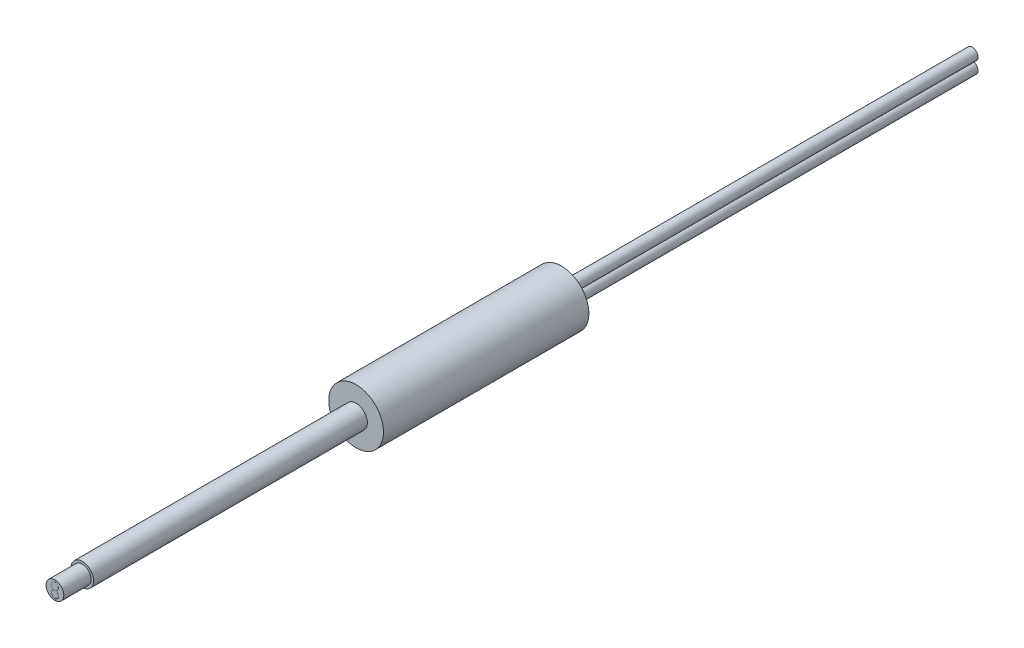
ISO-10303-21;
HEADER;
FILE_DESCRIPTION(('STEP AP214'),'2;1');
FILE_NAME('part.step','',(''),(''),'','','');
FILE_SCHEMA(('AUTOMOTIVE_DESIGN { 1 0 10303 214 1 1 1 1 }'));
ENDSEC;
DATA;
#1=APPLICATION_CONTEXT('core data for automotive mechanical design processes');
#2=APPLICATION_PROTOCOL_DEFINITION('international standard','automotive_design',2000,#1);
#3=PRODUCT_CONTEXT('',#1,'mechanical');
#4=PRODUCT('Part','Part','',(#3));
#5=PRODUCT_RELATED_PRODUCT_CATEGORY('part','',(#4));
#6=PRODUCT_DEFINITION_FORMATION('','',#4);
#7=PRODUCT_DEFINITION_CONTEXT('part definition',#1,'design');
#8=PRODUCT_DEFINITION('design','',#6,#7);
#9=PRODUCT_DEFINITION_SHAPE('','',#8);
#10=(LENGTH_UNIT() NAMED_UNIT(*) SI_UNIT(.MILLI.,.METRE.));
#11=(NAMED_UNIT(*) PLANE_ANGLE_UNIT() SI_UNIT($,.RADIAN.));
#12=(NAMED_UNIT(*) SI_UNIT($,.STERADIAN.) SOLID_ANGLE_UNIT());
#13=UNCERTAINTY_MEASURE_WITH_UNIT(LENGTH_MEASURE(1.E-05),#10,'distance_accuracy_value','');
#14=(GEOMETRIC_REPRESENTATION_CONTEXT(3) GLOBAL_UNCERTAINTY_ASSIGNED_CONTEXT((#13)) GLOBAL_UNIT_ASSIGNED_CONTEXT((#10,
#11,#12)) REPRESENTATION_CONTEXT('',''));
#15=CARTESIAN_POINT('',(0.,0.,0.));
#16=DIRECTION('',(0.,0.,1.));
#17=DIRECTION('',(1.,0.,0.));
#18=AXIS2_PLACEMENT_3D('',#15,#16,#17);
#19=CARTESIAN_POINT('',(0.,0.,-15.));
#20=DIRECTION('',(0.,0.,1.));
#21=DIRECTION('',(1.,0.,0.));
#22=AXIS2_PLACEMENT_3D('',#19,#20,#21);
#23=CYLINDRICAL_SURFACE('',#22,2.);
#24=CARTESIAN_POINT('',(0.,0.,-15.));
#25=DIRECTION('',(0.,0.,1.));
#26=DIRECTION('',(1.,0.,0.));
#27=AXIS2_PLACEMENT_3D('',#24,#25,#26);
#28=CIRCLE('',#27,2.);
#29=CARTESIAN_POINT('',(2.,0.,-15.));
#30=VERTEX_POINT('',#29);
#31=EDGE_CURVE('E53',#30,#30,#28,.T.);
#32=ORIENTED_EDGE('',*,*,#31,.T.);
#33=EDGE_LOOP('',(#32));
#34=FACE_BOUND('',#33,.T.);
#35=CARTESIAN_POINT('',(0.,0.,0.));
#36=DIRECTION('',(0.,0.,1.));
#37=DIRECTION('',(1.,0.,0.));
#38=AXIS2_PLACEMENT_3D('',#35,#36,#37);
#39=CIRCLE('',#38,2.);
#40=CARTESIAN_POINT('',(2.,0.,0.));
#41=VERTEX_POINT('',#40);
#42=EDGE_CURVE('E50',#41,#41,#39,.T.);
#43=ORIENTED_EDGE('',*,*,#42,.F.);
#44=EDGE_LOOP('',(#43));
#45=FACE_BOUND('',#44,.T.);
#46=ADVANCED_FACE('F33',(#34,#45),#23,.T.);
#47=CARTESIAN_POINT('',(0.,0.,-15.));
#48=DIRECTION('',(0.,0.,1.));
#49=DIRECTION('',(1.,0.,0.));
#50=AXIS2_PLACEMENT_3D('',#47,#48,#49);
#51=PLANE('',#50);
#52=CARTESIAN_POINT('',(0.,-0.428821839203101,-15.));
#53=DIRECTION('',(0.,0.,1.));
#54=DIRECTION('',(1.,0.,0.));
#55=AXIS2_PLACEMENT_3D('',#52,#53,#54);
#56=CIRCLE('',#55,0.418821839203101);
#57=CARTESIAN_POINT('',(0.418821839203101,-0.428821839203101,-15.));
#58=VERTEX_POINT('',#57);
#59=EDGE_CURVE('E10',#58,#58,#56,.F.);
#60=ORIENTED_EDGE('',*,*,#59,.F.);
#61=EDGE_LOOP('',(#60));
#62=FACE_BOUND('',#61,.T.);
#63=CARTESIAN_POINT('',(0.,0.428821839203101,-15.));
#64=DIRECTION('',(0.,0.,1.));
#65=DIRECTION('',(1.,0.,0.));
#66=AXIS2_PLACEMENT_3D('',#63,#64,#65);
#67=CIRCLE('',#66,0.418821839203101);
#68=CARTESIAN_POINT('',(0.418821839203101,0.428821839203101,-15.));
#69=VERTEX_POINT('',#68);
#70=EDGE_CURVE('E39',#69,#69,#67,.F.);
#71=ORIENTED_EDGE('',*,*,#70,.F.);
#72=EDGE_LOOP('',(#71));
#73=FACE_BOUND('',#72,.T.);
#74=ORIENTED_EDGE('',*,*,#31,.F.);
#75=EDGE_LOOP('',(#74));
#76=FACE_BOUND('',#75,.T.);
#77=ADVANCED_FACE('F143',(#62,#73,#76),#51,.F.);
#78=CARTESIAN_POINT('',(0.,0.,0.));
#79=DIRECTION('',(0.,0.,1.));
#80=DIRECTION('',(1.,0.,0.));
#81=AXIS2_PLACEMENT_3D('',#78,#79,#80);
#82=PLANE('',#81);
#83=CARTESIAN_POINT('',(0.,0.,0.));
#84=DIRECTION('',(0.,0.,1.));
#85=DIRECTION('',(1.,0.,0.));
#86=AXIS2_PLACEMENT_3D('',#83,#84,#85);
#87=CIRCLE('',#86,0.825);
#88=CARTESIAN_POINT('',(0.825,0.,0.));
#89=VERTEX_POINT('',#88);
#90=EDGE_CURVE('E47',#89,#89,#87,.T.);
#91=ORIENTED_EDGE('',*,*,#90,.F.);
#92=EDGE_LOOP('',(#91));
#93=FACE_BOUND('',#92,.T.);
#94=ORIENTED_EDGE('',*,*,#42,.T.);
#95=EDGE_LOOP('',(#94));
#96=FACE_BOUND('',#95,.T.);
#97=ADVANCED_FACE('F137',(#93,#96),#82,.T.);
#98=CARTESIAN_POINT('',(0.,0.,20.));
#99=DIRECTION('',(0.,0.,-1.));
#100=DIRECTION('',(-1.,0.,0.));
#101=AXIS2_PLACEMENT_3D('',#98,#99,#100);
#102=CYLINDRICAL_SURFACE('',#101,0.825);
#103=CARTESIAN_POINT('',(0.,0.,20.));
#104=DIRECTION('',(0.,0.,1.));
#105=DIRECTION('',(1.,0.,0.));
#106=AXIS2_PLACEMENT_3D('',#103,#104,#105);
#107=CIRCLE('',#106,0.825);
#108=CARTESIAN_POINT('',(0.825,0.,20.));
#109=VERTEX_POINT('',#108);
#110=EDGE_CURVE('E54',#109,#109,#107,.T.);
#111=ORIENTED_EDGE('',*,*,#110,.F.);
#112=EDGE_LOOP('',(#111));
#113=FACE_BOUND('',#112,.T.);
#114=ORIENTED_EDGE('',*,*,#90,.T.);
#115=EDGE_LOOP('',(#114));
#116=FACE_BOUND('',#115,.T.);
#117=ADVANCED_FACE('F131',(#113,#116),#102,.T.);
#118=CARTESIAN_POINT('',(0.,0.,20.));
#119=DIRECTION('',(0.,0.,1.));
#120=DIRECTION('',(1.,0.,0.));
#121=AXIS2_PLACEMENT_3D('',#118,#119,#120);
#122=PLANE('',#121);
#123=CARTESIAN_POINT('',(0.,0.,20.));
#124=DIRECTION('',(0.,0.,1.));
#125=DIRECTION('',(1.,0.,0.));
#126=AXIS2_PLACEMENT_3D('',#123,#124,#125);
#127=CIRCLE('',#126,0.65);
#128=CARTESIAN_POINT('',(0.65,0.,20.));
#129=VERTEX_POINT('',#128);
#130=EDGE_CURVE('E43',#129,#129,#127,.T.);
#131=ORIENTED_EDGE('',*,*,#130,.F.);
#132=EDGE_LOOP('',(#131));
#133=FACE_BOUND('',#132,.T.);
#134=ORIENTED_EDGE('',*,*,#110,.T.);
#135=EDGE_LOOP('',(#134));
#136=FACE_BOUND('',#135,.T.);
#137=ADVANCED_FACE('F125',(#133,#136),#122,.T.);
#138=CARTESIAN_POINT('',(0.,0.,22.));
#139=DIRECTION('',(0.,0.,-1.));
#140=DIRECTION('',(-1.,0.,0.));
#141=AXIS2_PLACEMENT_3D('',#138,#139,#140);
#142=CYLINDRICAL_SURFACE('',#141,0.65);
#143=CARTESIAN_POINT('',(0.,0.,22.));
#144=DIRECTION('',(0.,0.,1.));
#145=DIRECTION('',(1.,0.,0.));
#146=AXIS2_PLACEMENT_3D('',#143,#144,#145);
#147=CIRCLE('',#146,0.65);
#148=CARTESIAN_POINT('',(0.65,0.,22.));
#149=VERTEX_POINT('',#148);
#150=EDGE_CURVE('E60',#149,#149,#147,.T.);
#151=ORIENTED_EDGE('',*,*,#150,.F.);
#152=EDGE_LOOP('',(#151));
#153=FACE_BOUND('',#152,.T.);
#154=ORIENTED_EDGE('',*,*,#130,.T.);
#155=EDGE_LOOP('',(#154));
#156=FACE_BOUND('',#155,.T.);
#157=ADVANCED_FACE('F115',(#153,#156),#142,.T.);
#158=CARTESIAN_POINT('',(0.,0.,22.));
#159=DIRECTION('',(0.,0.,1.));
#160=DIRECTION('',(1.,0.,0.));
#161=AXIS2_PLACEMENT_3D('',#158,#159,#160);
#162=PLANE('',#161);
#163=CARTESIAN_POINT('',(0.,0.265,22.));
#164=DIRECTION('',(0.,0.,1.));
#165=DIRECTION('',(1.,0.,0.));
#166=AXIS2_PLACEMENT_3D('',#163,#164,#165);
#167=CIRCLE('',#166,0.255);
#168=CARTESIAN_POINT('',(0.255,0.265,22.));
#169=VERTEX_POINT('',#168);
#170=EDGE_CURVE('E84',#169,#169,#167,.T.);
#171=ORIENTED_EDGE('',*,*,#170,.F.);
#172=EDGE_LOOP('',(#171));
#173=FACE_BOUND('',#172,.T.);
#174=CARTESIAN_POINT('',(0.,-0.265,22.));
#175=DIRECTION('',(0.,0.,1.));
#176=DIRECTION('',(1.,0.,0.));
#177=AXIS2_PLACEMENT_3D('',#174,#175,#176);
#178=CIRCLE('',#177,0.255);
#179=CARTESIAN_POINT('',(0.255,-0.265,22.));
#180=VERTEX_POINT('',#179);
#181=EDGE_CURVE('E71',#180,#180,#178,.T.);
#182=ORIENTED_EDGE('',*,*,#181,.F.);
#183=EDGE_LOOP('',(#182));
#184=FACE_BOUND('',#183,.T.);
#185=ORIENTED_EDGE('',*,*,#150,.T.);
#186=EDGE_LOOP('',(#185));
#187=FACE_BOUND('',#186,.T.);
#188=ADVANCED_FACE('F111',(#173,#184,#187),#162,.T.);
#189=CARTESIAN_POINT('',(0.,0.428821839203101,-45.));
#190=DIRECTION('',(0.,0.,1.));
#191=DIRECTION('',(1.,0.,0.));
#192=AXIS2_PLACEMENT_3D('',#189,#190,#191);
#193=CYLINDRICAL_SURFACE('',#192,0.418821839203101);
#194=CARTESIAN_POINT('',(0.,0.428821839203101,-45.));
#195=DIRECTION('',(0.,0.,-1.));
#196=DIRECTION('',(-1.,0.,0.));
#197=AXIS2_PLACEMENT_3D('',#194,#195,#196);
#198=CIRCLE('',#197,0.418821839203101);
#199=CARTESIAN_POINT('',(-0.418821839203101,0.428821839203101,-45.));
#200=VERTEX_POINT('',#199);
#201=EDGE_CURVE('E64',#200,#200,#198,.T.);
#202=ORIENTED_EDGE('',*,*,#201,.F.);
#203=EDGE_LOOP('',(#202));
#204=FACE_BOUND('',#203,.T.);
#205=ORIENTED_EDGE('',*,*,#70,.T.);
#206=EDGE_LOOP('',(#205));
#207=FACE_BOUND('',#206,.T.);
#208=ADVANCED_FACE('F114',(#204,#207),#193,.T.);
#209=CARTESIAN_POINT('',(0.,0.428821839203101,-45.));
#210=DIRECTION('',(0.,0.,-1.));
#211=DIRECTION('',(-1.,0.,0.));
#212=AXIS2_PLACEMENT_3D('',#209,#210,#211);
#213=PLANE('',#212);
#214=ORIENTED_EDGE('',*,*,#201,.T.);
#215=EDGE_LOOP('',(#214));
#216=FACE_BOUND('',#215,.T.);
#217=ADVANCED_FACE('F161',(#216),#213,.T.);
#218=CARTESIAN_POINT('',(0.,-0.428821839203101,-45.));
#219=DIRECTION('',(0.,0.,1.));
#220=DIRECTION('',(1.,0.,0.));
#221=AXIS2_PLACEMENT_3D('',#218,#219,#220);
#222=CYLINDRICAL_SURFACE('',#221,0.418821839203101);
#223=CARTESIAN_POINT('',(0.,-0.428821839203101,-45.));
#224=DIRECTION('',(0.,0.,-1.));
#225=DIRECTION('',(-1.,0.,0.));
#226=AXIS2_PLACEMENT_3D('',#223,#224,#225);
#227=CIRCLE('',#226,0.418821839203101);
#228=CARTESIAN_POINT('',(-0.418821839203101,-0.428821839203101,-45.));
#229=VERTEX_POINT('',#228);
#230=EDGE_CURVE('E67',#229,#229,#227,.T.);
#231=ORIENTED_EDGE('',*,*,#230,.F.);
#232=EDGE_LOOP('',(#231));
#233=FACE_BOUND('',#232,.T.);
#234=ORIENTED_EDGE('',*,*,#59,.T.);
#235=EDGE_LOOP('',(#234));
#236=FACE_BOUND('',#235,.T.);
#237=ADVANCED_FACE('F165',(#233,#236),#222,.T.);
#238=CARTESIAN_POINT('',(0.,-0.428821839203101,-45.));
#239=DIRECTION('',(0.,0.,-1.));
#240=DIRECTION('',(-1.,0.,0.));
#241=AXIS2_PLACEMENT_3D('',#238,#239,#240);
#242=PLANE('',#241);
#243=ORIENTED_EDGE('',*,*,#230,.T.);
#244=EDGE_LOOP('',(#243));
#245=FACE_BOUND('',#244,.T.);
#246=ADVANCED_FACE('F169',(#245),#242,.T.);
#247=CARTESIAN_POINT('',(0.,-0.265,21.9));
#248=DIRECTION('',(0.,0.,1.));
#249=DIRECTION('',(1.,0.,0.));
#250=AXIS2_PLACEMENT_3D('',#247,#248,#249);
#251=CYLINDRICAL_SURFACE('',#250,0.255);
#252=CARTESIAN_POINT('',(0.,-0.265,21.9));
#253=DIRECTION('',(0.,0.,1.));
#254=DIRECTION('',(1.,0.,0.));
#255=AXIS2_PLACEMENT_3D('',#252,#253,#254);
#256=CIRCLE('',#255,0.255);
#257=CARTESIAN_POINT('',(0.255,-0.265,21.9));
#258=VERTEX_POINT('',#257);
#259=EDGE_CURVE('E74',#258,#258,#256,.T.);
#260=ORIENTED_EDGE('',*,*,#259,.F.);
#261=EDGE_LOOP('',(#260));
#262=FACE_BOUND('',#261,.T.);
#263=ORIENTED_EDGE('',*,*,#181,.T.);
#264=EDGE_LOOP('',(#263));
#265=FACE_BOUND('',#264,.T.);
#266=ADVANCED_FACE('F173',(#262,#265),#251,.F.);
#267=CARTESIAN_POINT('',(0.,-0.265,21.9));
#268=DIRECTION('',(0.,0.,1.));
#269=DIRECTION('',(1.,0.,0.));
#270=AXIS2_PLACEMENT_3D('',#267,#268,#269);
#271=PLANE('',#270);
#272=CARTESIAN_POINT('',(0.,-0.265,21.9));
#273=DIRECTION('',(0.,0.,1.));
#274=DIRECTION('',(1.,0.,0.));
#275=AXIS2_PLACEMENT_3D('',#272,#273,#274);
#276=CIRCLE('',#275,0.25);
#277=CARTESIAN_POINT('',(0.25,-0.265,21.9));
#278=VERTEX_POINT('',#277);
#279=EDGE_CURVE('E75',#278,#278,#276,.T.);
#280=ORIENTED_EDGE('',*,*,#279,.F.);
#281=EDGE_LOOP('',(#280));
#282=FACE_BOUND('',#281,.T.);
#283=ORIENTED_EDGE('',*,*,#259,.T.);
#284=EDGE_LOOP('',(#283));
#285=FACE_BOUND('',#284,.T.);
#286=ADVANCED_FACE('F177',(#282,#285),#271,.T.);
#287=CARTESIAN_POINT('',(0.,-0.265,21.9));
#288=DIRECTION('',(0.,0.,1.));
#289=DIRECTION('',(1.,0.,0.));
#290=AXIS2_PLACEMENT_3D('',#287,#288,#289);
#291=CYLINDRICAL_SURFACE('',#290,0.25);
#292=ORIENTED_EDGE('',*,*,#279,.T.);
#293=EDGE_LOOP('',(#292));
#294=FACE_BOUND('',#293,.T.);
#295=CARTESIAN_POINT('',(0.,-0.265,22.));
#296=DIRECTION('',(0.,0.,1.));
#297=DIRECTION('',(1.,0.,0.));
#298=AXIS2_PLACEMENT_3D('',#295,#296,#297);
#299=CIRCLE('',#298,0.25);
#300=CARTESIAN_POINT('',(0.25,-0.265,22.));
#301=VERTEX_POINT('',#300);
#302=EDGE_CURVE('E79',#301,#301,#299,.T.);
#303=ORIENTED_EDGE('',*,*,#302,.F.);
#304=EDGE_LOOP('',(#303));
#305=FACE_BOUND('',#304,.T.);
#306=ADVANCED_FACE('F107',(#294,#305),#291,.T.);
#307=CARTESIAN_POINT('',(0.,0.265,21.9));
#308=DIRECTION('',(0.,0.,1.));
#309=DIRECTION('',(1.,0.,0.));
#310=AXIS2_PLACEMENT_3D('',#307,#308,#309);
#311=CYLINDRICAL_SURFACE('',#310,0.255);
#312=CARTESIAN_POINT('',(0.,0.265,21.9));
#313=DIRECTION('',(0.,0.,1.));
#314=DIRECTION('',(1.,0.,0.));
#315=AXIS2_PLACEMENT_3D('',#312,#313,#314);
#316=CIRCLE('',#315,0.255);
#317=CARTESIAN_POINT('',(0.255,0.265,21.9));
#318=VERTEX_POINT('',#317);
#319=EDGE_CURVE('E70',#318,#318,#316,.T.);
#320=ORIENTED_EDGE('',*,*,#319,.F.);
#321=EDGE_LOOP('',(#320));
#322=FACE_BOUND('',#321,.T.);
#323=ORIENTED_EDGE('',*,*,#170,.T.);
#324=EDGE_LOOP('',(#323));
#325=FACE_BOUND('',#324,.T.);
#326=ADVANCED_FACE('F101',(#322,#325),#311,.F.);
#327=CARTESIAN_POINT('',(0.,0.265,21.9));
#328=DIRECTION('',(0.,0.,1.));
#329=DIRECTION('',(1.,0.,0.));
#330=AXIS2_PLACEMENT_3D('',#327,#328,#329);
#331=PLANE('',#330);
#332=CARTESIAN_POINT('',(0.,0.265,21.9));
#333=DIRECTION('',(0.,0.,1.));
#334=DIRECTION('',(1.,0.,0.));
#335=AXIS2_PLACEMENT_3D('',#332,#333,#334);
#336=CIRCLE('',#335,0.25);
#337=CARTESIAN_POINT('',(0.25,0.265,21.9));
#338=VERTEX_POINT('',#337);
#339=EDGE_CURVE('E87',#338,#338,#336,.T.);
#340=ORIENTED_EDGE('',*,*,#339,.F.);
#341=EDGE_LOOP('',(#340));
#342=FACE_BOUND('',#341,.T.);
#343=ORIENTED_EDGE('',*,*,#319,.T.);
#344=EDGE_LOOP('',(#343));
#345=FACE_BOUND('',#344,.T.);
#346=ADVANCED_FACE('F98',(#342,#345),#331,.T.);
#347=CARTESIAN_POINT('',(0.,0.265,21.9));
#348=DIRECTION('',(0.,0.,1.));
#349=DIRECTION('',(1.,0.,0.));
#350=AXIS2_PLACEMENT_3D('',#347,#348,#349);
#351=CYLINDRICAL_SURFACE('',#350,0.25);
#352=ORIENTED_EDGE('',*,*,#339,.T.);
#353=EDGE_LOOP('',(#352));
#354=FACE_BOUND('',#353,.T.);
#355=CARTESIAN_POINT('',(0.,0.265,22.));
#356=DIRECTION('',(0.,0.,1.));
#357=DIRECTION('',(1.,0.,0.));
#358=AXIS2_PLACEMENT_3D('',#355,#356,#357);
#359=CIRCLE('',#358,0.25);
#360=CARTESIAN_POINT('',(0.25,0.265,22.));
#361=VERTEX_POINT('',#360);
#362=EDGE_CURVE('E78',#361,#361,#359,.T.);
#363=ORIENTED_EDGE('',*,*,#362,.F.);
#364=EDGE_LOOP('',(#363));
#365=FACE_BOUND('',#364,.T.);
#366=ADVANCED_FACE('F95',(#354,#365),#351,.T.);
#367=ORIENTED_EDGE('',*,*,#302,.T.);
#368=EDGE_LOOP('',(#367));
#369=FACE_BOUND('',#368,.T.);
#370=ADVANCED_FACE('F118',(#369),#162,.T.);
#371=ORIENTED_EDGE('',*,*,#362,.T.);
#372=EDGE_LOOP('',(#371));
#373=FACE_BOUND('',#372,.T.);
#374=ADVANCED_FACE('F117',(#373),#162,.T.);
#375=CLOSED_SHELL('',(#46,#77,#97,#117,#137,#157,#188,#208,#217,#237,#246,#266,#286,#306,#326,
#346,#366,#370,#374));
#376=MANIFOLD_SOLID_BREP('B2',#375);
#377=ADVANCED_BREP_SHAPE_REPRESENTATION('',(#18,#376),#14);
#378=SHAPE_DEFINITION_REPRESENTATION(#9,#377);
ENDSEC;
END-ISO-10303-21;
